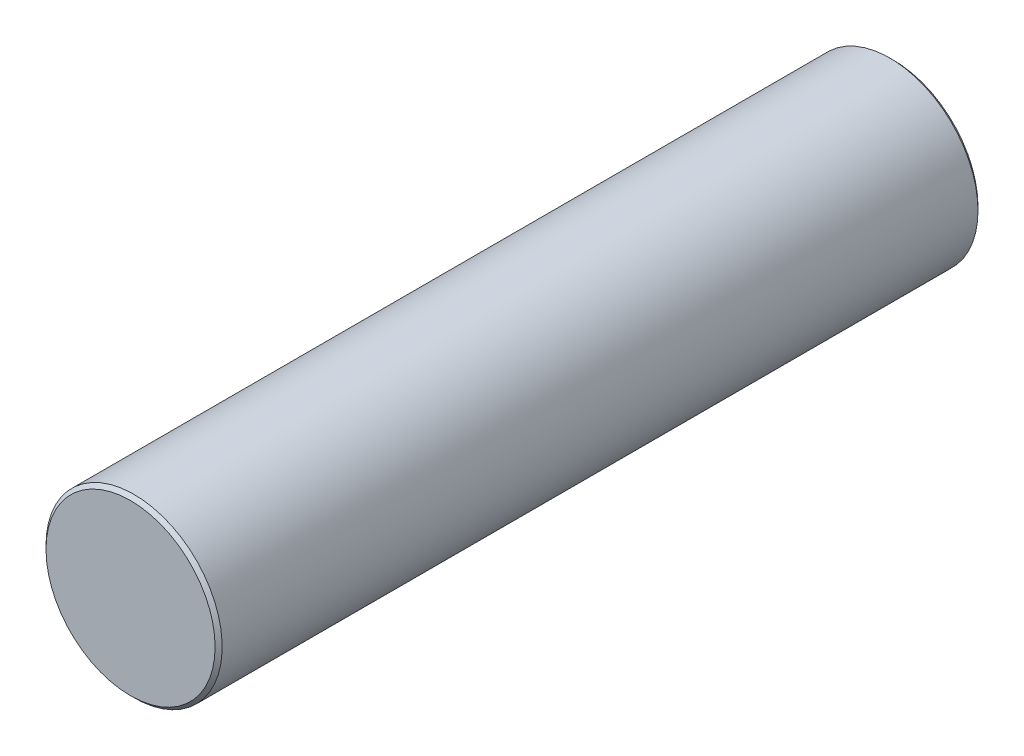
ISO-10303-21;
HEADER;
FILE_DESCRIPTION(('STEP AP214'),'2;1');
FILE_NAME('part.step','',(''),(''),'','','');
FILE_SCHEMA(('AUTOMOTIVE_DESIGN { 1 0 10303 214 1 1 1 1 }'));
ENDSEC;
DATA;
#1=APPLICATION_CONTEXT('core data for automotive mechanical design processes');
#2=APPLICATION_PROTOCOL_DEFINITION('international standard','automotive_design',2000,#1);
#3=PRODUCT_CONTEXT('',#1,'mechanical');
#4=PRODUCT('Part','Part','',(#3));
#5=PRODUCT_RELATED_PRODUCT_CATEGORY('part','',(#4));
#6=PRODUCT_DEFINITION_FORMATION('','',#4);
#7=PRODUCT_DEFINITION_CONTEXT('part definition',#1,'design');
#8=PRODUCT_DEFINITION('design','',#6,#7);
#9=PRODUCT_DEFINITION_SHAPE('','',#8);
#10=(LENGTH_UNIT() NAMED_UNIT(*) SI_UNIT(.MILLI.,.METRE.));
#11=(NAMED_UNIT(*) PLANE_ANGLE_UNIT() SI_UNIT($,.RADIAN.));
#12=(NAMED_UNIT(*) SI_UNIT($,.STERADIAN.) SOLID_ANGLE_UNIT());
#13=UNCERTAINTY_MEASURE_WITH_UNIT(LENGTH_MEASURE(1.E-05),#10,'distance_accuracy_value','');
#14=(GEOMETRIC_REPRESENTATION_CONTEXT(3) GLOBAL_UNCERTAINTY_ASSIGNED_CONTEXT((#13)) GLOBAL_UNIT_ASSIGNED_CONTEXT((#10,
#11,#12)) REPRESENTATION_CONTEXT('',''));
#15=CARTESIAN_POINT('',(0.,0.,0.));
#16=DIRECTION('',(0.,0.,1.));
#17=DIRECTION('',(1.,0.,0.));
#18=AXIS2_PLACEMENT_3D('',#15,#16,#17);
#19=CARTESIAN_POINT('',(0.,0.,54.999999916));
#20=DIRECTION('',(0.,0.,-1.));
#21=DIRECTION('',(-1.,0.,0.));
#22=AXIS2_PLACEMENT_3D('',#19,#20,#21);
#23=CYLINDRICAL_SURFACE('',#22,6.35);
#24=CARTESIAN_POINT('',(0.,0.,0.254000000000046));
#25=DIRECTION('',(0.,0.,1.));
#26=DIRECTION('',(1.,0.,0.));
#27=AXIS2_PLACEMENT_3D('',#24,#25,#26);
#28=CIRCLE('',#27,6.35);
#29=CARTESIAN_POINT('',(-6.35,0.,0.254000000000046));
#30=VERTEX_POINT('',#29);
#31=EDGE_CURVE('E48',#30,#30,#28,.T.);
#32=CARTESIAN_POINT('',(0.,0.,54.745999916));
#33=DIRECTION('',(0.,0.,1.));
#34=DIRECTION('',(1.,0.,0.));
#35=AXIS2_PLACEMENT_3D('',#32,#33,#34);
#36=CIRCLE('',#35,6.35);
#37=CARTESIAN_POINT('',(-6.35,0.,54.745999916));
#38=VERTEX_POINT('',#37);
#39=EDGE_CURVE('E52',#38,#38,#36,.F.);
#40=CARTESIAN_POINT('',(-6.35,0.,0.254000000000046));
#41=CARTESIAN_POINT('',(-6.35,0.,0.821624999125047));
#42=CARTESIAN_POINT('',(-6.35,0.,1.38924999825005));
#43=CARTESIAN_POINT('',(-6.35,0.,2.52449999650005));
#44=CARTESIAN_POINT('',(-6.35,0.,3.09212499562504));
#45=CARTESIAN_POINT('',(-6.35,0.,4.22737499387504));
#46=CARTESIAN_POINT('',(-6.35,0.,4.79499999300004));
#47=CARTESIAN_POINT('',(-6.35,0.,5.93024999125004));
#48=CARTESIAN_POINT('',(-6.35,0.,6.49787499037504));
#49=CARTESIAN_POINT('',(-6.35,0.,7.63312498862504));
#50=CARTESIAN_POINT('',(-6.35,0.,8.20074998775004));
#51=CARTESIAN_POINT('',(-6.35,0.,9.33599998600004));
#52=CARTESIAN_POINT('',(-6.35,0.,9.90362498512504));
#53=CARTESIAN_POINT('',(-6.35,0.,11.038874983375));
#54=CARTESIAN_POINT('',(-6.35,0.,11.6064999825));
#55=CARTESIAN_POINT('',(-6.35,0.,12.74174998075));
#56=CARTESIAN_POINT('',(-6.35,0.,13.309374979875));
#57=CARTESIAN_POINT('',(-6.35,0.,14.444624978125));
#58=CARTESIAN_POINT('',(-6.35,0.,15.01224997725));
#59=CARTESIAN_POINT('',(-6.35,0.,16.1474999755));
#60=CARTESIAN_POINT('',(-6.35,0.,16.715124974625));
#61=CARTESIAN_POINT('',(-6.35,0.,17.850374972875));
#62=CARTESIAN_POINT('',(-6.35,0.,18.417999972));
#63=CARTESIAN_POINT('',(-6.35,0.,19.55324997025));
#64=CARTESIAN_POINT('',(-6.35,0.,20.120874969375));
#65=CARTESIAN_POINT('',(-6.35,0.,21.256124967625));
#66=CARTESIAN_POINT('',(-6.35,0.,21.82374996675));
#67=CARTESIAN_POINT('',(-6.35,0.,22.958999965));
#68=CARTESIAN_POINT('',(-6.35,0.,23.526624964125));
#69=CARTESIAN_POINT('',(-6.35,0.,24.661874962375));
#70=CARTESIAN_POINT('',(-6.35,0.,25.2294999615));
#71=CARTESIAN_POINT('',(-6.35,0.,26.36474995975));
#72=CARTESIAN_POINT('',(-6.35,0.,26.932374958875));
#73=CARTESIAN_POINT('',(-6.35,0.,28.067624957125));
#74=CARTESIAN_POINT('',(-6.35,0.,28.63524995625));
#75=CARTESIAN_POINT('',(-6.35,0.,29.7704999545));
#76=CARTESIAN_POINT('',(-6.35,0.,30.338124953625));
#77=CARTESIAN_POINT('',(-6.35,0.,31.473374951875));
#78=CARTESIAN_POINT('',(-6.35,0.,32.040999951));
#79=CARTESIAN_POINT('',(-6.35,0.,33.17624994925));
#80=CARTESIAN_POINT('',(-6.35,0.,33.743874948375));
#81=CARTESIAN_POINT('',(-6.35,0.,34.879124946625));
#82=CARTESIAN_POINT('',(-6.35,0.,35.44674994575));
#83=CARTESIAN_POINT('',(-6.35,0.,36.581999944));
#84=CARTESIAN_POINT('',(-6.35,0.,37.149624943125));
#85=CARTESIAN_POINT('',(-6.35,0.,38.284874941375));
#86=CARTESIAN_POINT('',(-6.35,0.,38.8524999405));
#87=CARTESIAN_POINT('',(-6.35,0.,39.98774993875));
#88=CARTESIAN_POINT('',(-6.35,0.,40.555374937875));
#89=CARTESIAN_POINT('',(-6.35,0.,41.690624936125));
#90=CARTESIAN_POINT('',(-6.35,0.,42.25824993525));
#91=CARTESIAN_POINT('',(-6.35,0.,43.3934999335));
#92=CARTESIAN_POINT('',(-6.35,0.,43.961124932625));
#93=CARTESIAN_POINT('',(-6.35,0.,45.096374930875));
#94=CARTESIAN_POINT('',(-6.35,0.,45.66399993));
#95=CARTESIAN_POINT('',(-6.35,0.,46.79924992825));
#96=CARTESIAN_POINT('',(-6.35,0.,47.366874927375));
#97=CARTESIAN_POINT('',(-6.35,0.,48.502124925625));
#98=CARTESIAN_POINT('',(-6.35,0.,49.06974992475));
#99=CARTESIAN_POINT('',(-6.35,0.,50.204999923));
#100=CARTESIAN_POINT('',(-6.35,0.,50.772624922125));
#101=CARTESIAN_POINT('',(-6.35,0.,51.907874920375));
#102=CARTESIAN_POINT('',(-6.35,0.,52.4754999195));
#103=CARTESIAN_POINT('',(-6.35,0.,53.61074991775));
#104=CARTESIAN_POINT('',(-6.35,0.,54.178374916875));
#105=CARTESIAN_POINT('',(-6.35,0.,54.745999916));
#106=B_SPLINE_CURVE_WITH_KNOTS('',3,(#40,#41,#42,#43,#44,#45,#46,#47,#48,#49,#50,#51,#52,#53,
#54,#55,#56,#57,#58,#59,#60,#61,#62,#63,#64,#65,#66,#67,#68,#69,#70,#71,#72,#73,#74,#75,#76,#77,
#78,#79,#80,#81,#82,#83,#84,#85,#86,#87,#88,#89,#90,#91,#92,#93,#94,#95,#96,#97,#98,#99,#100,
#101,#102,#103,#104,#105),.UNSPECIFIED.,.F.,.F.,(4,2,2,2,2,2,2,2,2,2,2,2,2,2,2,2,2,2,2,2,2,2,2,
2,2,2,2,2,2,2,2,2,4),(0.,1.702874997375,3.40574999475,5.108624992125,6.81149998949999,
8.514374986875,10.21724998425,11.920124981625,13.622999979,15.325874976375,17.02874997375,
18.731624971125,20.4344999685,22.137374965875,23.84024996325,25.543124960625,27.245999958,
28.948874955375,30.65174995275,32.354624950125,34.0574999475,35.760374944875,37.46324994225,
39.166124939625,40.868999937,42.571874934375,44.27474993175,45.977624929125,47.6804999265,
49.383374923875,51.08624992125,52.789124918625,54.491999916),.UNSPECIFIED.);
#107=EDGE_CURVE('BSEAM37',#30,#38,#106,.T.);
#108=ORIENTED_EDGE('',*,*,#31,.T.);
#109=ORIENTED_EDGE('',*,*,#39,.T.);
#110=ORIENTED_EDGE('',*,*,#107,.T.);
#111=ORIENTED_EDGE('',*,*,#107,.F.);
#112=EDGE_LOOP('',(#108,#110,#109,#111));
#113=FACE_BOUND('',#112,.T.);
#114=ADVANCED_FACE('F37',(#113),#23,.T.);
#115=CARTESIAN_POINT('',(0.,0.,54.999999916));
#116=DIRECTION('',(0.,0.,1.));
#117=DIRECTION('',(1.,0.,0.));
#118=AXIS2_PLACEMENT_3D('',#115,#116,#117);
#119=PLANE('',#118);
#120=CARTESIAN_POINT('',(0.,0.,54.999999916));
#121=DIRECTION('',(0.,0.,1.));
#122=DIRECTION('',(1.,0.,0.));
#123=AXIS2_PLACEMENT_3D('',#120,#121,#122);
#124=CIRCLE('',#123,6.09600000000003);
#125=CARTESIAN_POINT('',(6.09600000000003,0.,54.999999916));
#126=VERTEX_POINT('',#125);
#127=EDGE_CURVE('E10',#126,#126,#124,.T.);
#128=ORIENTED_EDGE('',*,*,#127,.T.);
#129=EDGE_LOOP('',(#128));
#130=FACE_BOUND('',#129,.T.);
#131=ADVANCED_FACE('F68',(#130),#119,.T.);
#132=CARTESIAN_POINT('',(0.,0.,0.));
#133=DIRECTION('',(0.,0.,1.));
#134=DIRECTION('',(1.,0.,0.));
#135=AXIS2_PLACEMENT_3D('',#132,#133,#134);
#136=PLANE('',#135);
#137=CARTESIAN_POINT('',(0.,0.,0.));
#138=DIRECTION('',(0.,0.,1.));
#139=DIRECTION('',(1.,0.,0.));
#140=AXIS2_PLACEMENT_3D('',#137,#138,#139);
#141=CIRCLE('',#140,6.09599999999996);
#142=CARTESIAN_POINT('',(6.09599999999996,0.,0.));
#143=VERTEX_POINT('',#142);
#144=EDGE_CURVE('E44',#143,#143,#141,.F.);
#145=ORIENTED_EDGE('',*,*,#144,.T.);
#146=EDGE_LOOP('',(#145));
#147=FACE_BOUND('',#146,.T.);
#148=ADVANCED_FACE('F65',(#147),#136,.F.);
#149=CARTESIAN_POINT('',(0.,0.,0.254000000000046));
#150=DIRECTION('',(0.,0.,1.));
#151=DIRECTION('',(1.,0.,0.));
#152=AXIS2_PLACEMENT_3D('',#149,#150,#151);
#153=CONICAL_SURFACE('',#152,6.35,0.785398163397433);
#154=ORIENTED_EDGE('',*,*,#144,.F.);
#155=EDGE_LOOP('',(#154));
#156=FACE_BOUND('',#155,.T.);
#157=ORIENTED_EDGE('',*,*,#31,.F.);
#158=EDGE_LOOP('',(#157));
#159=FACE_BOUND('',#158,.T.);
#160=ADVANCED_FACE('F61',(#156,#159),#153,.T.);
#161=CARTESIAN_POINT('',(0.,0.,54.999999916));
#162=DIRECTION('',(0.,0.,-1.));
#163=DIRECTION('',(-1.,0.,0.));
#164=AXIS2_PLACEMENT_3D('',#161,#162,#163);
#165=CONICAL_SURFACE('',#164,6.09600000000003,0.785398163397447);
#166=ORIENTED_EDGE('',*,*,#39,.F.);
#167=EDGE_LOOP('',(#166));
#168=FACE_BOUND('',#167,.T.);
#169=ORIENTED_EDGE('',*,*,#127,.F.);
#170=EDGE_LOOP('',(#169));
#171=FACE_BOUND('',#170,.T.);
#172=ADVANCED_FACE('F39',(#168,#171),#165,.T.);
#173=CLOSED_SHELL('',(#114,#131,#148,#160,#172));
#174=MANIFOLD_SOLID_BREP('B2',#173);
#175=ADVANCED_BREP_SHAPE_REPRESENTATION('',(#18,#174),#14);
#176=SHAPE_DEFINITION_REPRESENTATION(#9,#175);
ENDSEC;
END-ISO-10303-21;
